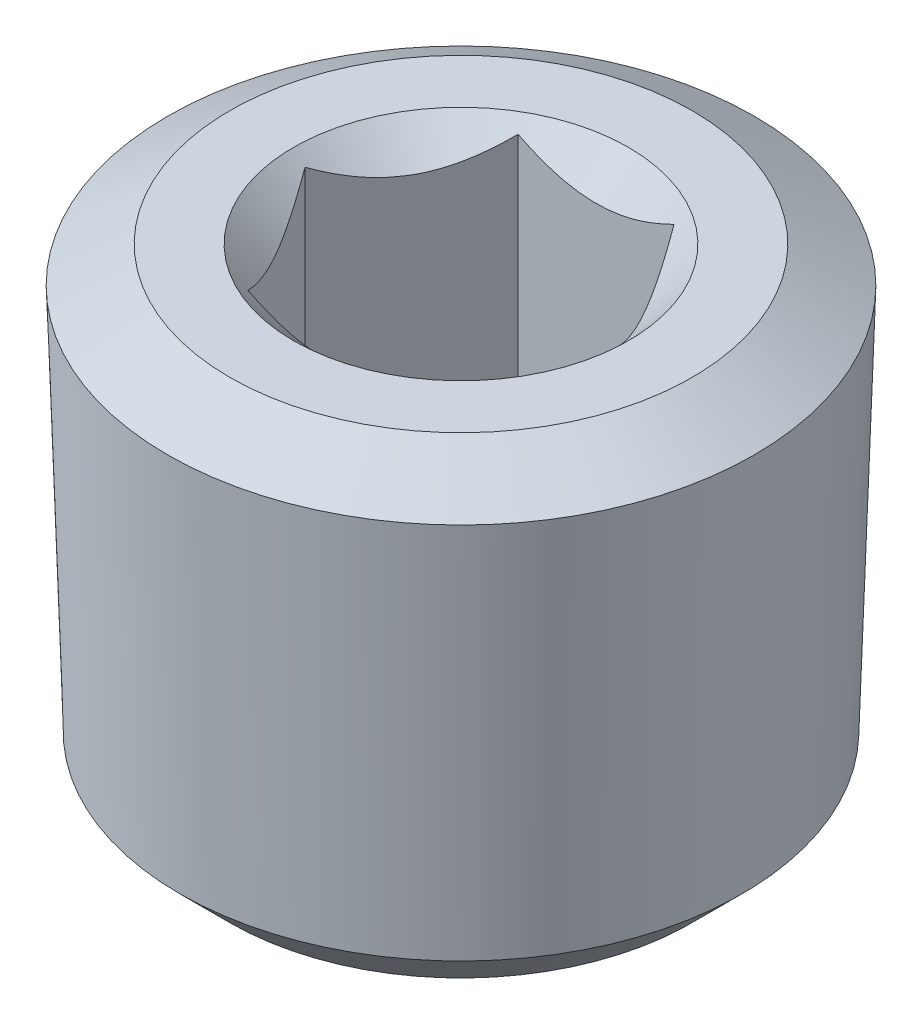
ISO-10303-21;
HEADER;
FILE_DESCRIPTION(('STEP AP214'),'2;1');
FILE_NAME('part.step','',(''),(''),'','','');
FILE_SCHEMA(('AUTOMOTIVE_DESIGN { 1 0 10303 214 1 1 1 1 }'));
ENDSEC;
DATA;
#1=APPLICATION_CONTEXT('core data for automotive mechanical design processes');
#2=APPLICATION_PROTOCOL_DEFINITION('international standard','automotive_design',2000,#1);
#3=PRODUCT_CONTEXT('',#1,'mechanical');
#4=PRODUCT('Part','Part','',(#3));
#5=PRODUCT_RELATED_PRODUCT_CATEGORY('part','',(#4));
#6=PRODUCT_DEFINITION_FORMATION('','',#4);
#7=PRODUCT_DEFINITION_CONTEXT('part definition',#1,'design');
#8=PRODUCT_DEFINITION('design','',#6,#7);
#9=PRODUCT_DEFINITION_SHAPE('','',#8);
#10=(LENGTH_UNIT() NAMED_UNIT(*) SI_UNIT(.MILLI.,.METRE.));
#11=(NAMED_UNIT(*) PLANE_ANGLE_UNIT() SI_UNIT($,.RADIAN.));
#12=(NAMED_UNIT(*) SI_UNIT($,.STERADIAN.) SOLID_ANGLE_UNIT());
#13=UNCERTAINTY_MEASURE_WITH_UNIT(LENGTH_MEASURE(1.E-05),#10,'distance_accuracy_value','');
#14=(GEOMETRIC_REPRESENTATION_CONTEXT(3) GLOBAL_UNCERTAINTY_ASSIGNED_CONTEXT((#13)) GLOBAL_UNIT_ASSIGNED_CONTEXT((#10,
#11,#12)) REPRESENTATION_CONTEXT('',''));
#15=CARTESIAN_POINT('',(0.,0.,0.));
#16=DIRECTION('',(0.,0.,1.));
#17=DIRECTION('',(1.,0.,0.));
#18=AXIS2_PLACEMENT_3D('',#15,#16,#17);
#19=CARTESIAN_POINT('',(0.,0.,0.));
#20=DIRECTION('',(0.,1.,0.));
#21=DIRECTION('',(0.,0.,1.));
#22=AXIS2_PLACEMENT_3D('',#19,#20,#21);
#23=PLANE('',#22);
#24=CARTESIAN_POINT('',(0.,0.,0.));
#25=DIRECTION('',(0.,1.,0.));
#26=DIRECTION('',(0.,0.,1.));
#27=AXIS2_PLACEMENT_3D('',#24,#25,#26);
#28=CIRCLE('',#27,3.937);
#29=CARTESIAN_POINT('',(0.,0.,3.937));
#30=VERTEX_POINT('',#29);
#31=EDGE_CURVE('E246',#30,#30,#28,.T.);
#32=ORIENTED_EDGE('',*,*,#31,.F.);
#33=EDGE_LOOP('',(#32));
#34=FACE_BOUND('',#33,.T.);
#35=CARTESIAN_POINT('',(0.,0.,0.));
#36=DIRECTION('',(0.,1.,0.));
#37=DIRECTION('',(0.,0.,1.));
#38=AXIS2_PLACEMENT_3D('',#35,#36,#37);
#39=CIRCLE('',#38,5.43200174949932);
#40=CARTESIAN_POINT('',(0.,0.,5.43200174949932));
#41=VERTEX_POINT('',#40);
#42=EDGE_CURVE('E12',#41,#41,#39,.T.);
#43=ORIENTED_EDGE('',*,*,#42,.T.);
#44=EDGE_LOOP('',(#43));
#45=FACE_BOUND('',#44,.T.);
#46=ADVANCED_FACE('F33',(#34,#45),#23,.T.);
#47=CARTESIAN_POINT('',(0.,0.,0.));
#48=DIRECTION('',(0.,-1.,0.));
#49=DIRECTION('',(0.,0.,-1.));
#50=AXIS2_PLACEMENT_3D('',#47,#48,#49);
#51=CONICAL_SURFACE('',#50,5.43200174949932,1.0471975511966);
#52=CARTESIAN_POINT('',(0.,-0.844737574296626,0.));
#53=DIRECTION('',(0.,1.,0.));
#54=DIRECTION('',(0.,0.,1.));
#55=AXIS2_PLACEMENT_3D('',#52,#53,#54);
#56=CIRCLE('',#55,6.89513014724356);
#57=CARTESIAN_POINT('',(0.,-0.844737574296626,6.89513014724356));
#58=VERTEX_POINT('',#57);
#59=EDGE_CURVE('E40',#58,#58,#56,.T.);
#60=ORIENTED_EDGE('',*,*,#59,.T.);
#61=EDGE_LOOP('',(#60));
#62=FACE_BOUND('',#61,.T.);
#63=ORIENTED_EDGE('',*,*,#42,.F.);
#64=EDGE_LOOP('',(#63));
#65=FACE_BOUND('',#64,.T.);
#66=ADVANCED_FACE('F236',(#62,#65),#51,.T.);
#67=CARTESIAN_POINT('',(0.,-0.844737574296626,0.));
#68=DIRECTION('',(0.,1.,0.));
#69=DIRECTION('',(0.,0.,1.));
#70=AXIS2_PLACEMENT_3D('',#67,#68,#69);
#71=CONICAL_SURFACE('',#70,6.89513014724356,0.0312064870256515);
#72=CARTESIAN_POINT('',(0.,-9.91996968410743,0.));
#73=DIRECTION('',(0.,1.,0.));
#74=DIRECTION('',(0.,0.,1.));
#75=AXIS2_PLACEMENT_3D('',#72,#73,#74);
#76=CIRCLE('',#75,6.61183206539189);
#77=CARTESIAN_POINT('',(0.,-9.91996968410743,6.61183206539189));
#78=VERTEX_POINT('',#77);
#79=EDGE_CURVE('E254',#78,#78,#76,.T.);
#80=ORIENTED_EDGE('',*,*,#79,.T.);
#81=EDGE_LOOP('',(#80));
#82=FACE_BOUND('',#81,.T.);
#83=ORIENTED_EDGE('',*,*,#59,.F.);
#84=EDGE_LOOP('',(#83));
#85=FACE_BOUND('',#84,.T.);
#86=ADVANCED_FACE('F241',(#82,#85),#71,.T.);
#87=CARTESIAN_POINT('',(0.,-9.91996968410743,0.));
#88=DIRECTION('',(0.,1.,0.));
#89=DIRECTION('',(0.,0.,1.));
#90=AXIS2_PLACEMENT_3D('',#87,#88,#89);
#91=CONICAL_SURFACE('',#90,6.61183206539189,0.785398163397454);
#92=CARTESIAN_POINT('',(0.,-11.0998,0.));
#93=DIRECTION('',(0.,1.,0.));
#94=DIRECTION('',(0.,0.,1.));
#95=AXIS2_PLACEMENT_3D('',#92,#93,#94);
#96=CIRCLE('',#95,5.43200174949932);
#97=CARTESIAN_POINT('',(0.,-11.0998,5.43200174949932));
#98=VERTEX_POINT('',#97);
#99=EDGE_CURVE('E250',#98,#98,#96,.T.);
#100=ORIENTED_EDGE('',*,*,#99,.T.);
#101=EDGE_LOOP('',(#100));
#102=FACE_BOUND('',#101,.T.);
#103=ORIENTED_EDGE('',*,*,#79,.F.);
#104=EDGE_LOOP('',(#103));
#105=FACE_BOUND('',#104,.T.);
#106=ADVANCED_FACE('F264',(#102,#105),#91,.T.);
#107=CARTESIAN_POINT('',(-5.43200174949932,-11.0998,0.));
#108=DIRECTION('',(0.,-1.,0.));
#109=DIRECTION('',(0.,0.,-1.));
#110=AXIS2_PLACEMENT_3D('',#107,#108,#109);
#111=PLANE('',#110);
#112=ORIENTED_EDGE('',*,*,#99,.F.);
#113=EDGE_LOOP('',(#112));
#114=FACE_BOUND('',#113,.T.);
#115=ADVANCED_FACE('F180',(#114),#111,.T.);
#116=CARTESIAN_POINT('',(0.,0.,0.));
#117=DIRECTION('',(0.,1.,0.));
#118=DIRECTION('',(0.,0.,1.));
#119=AXIS2_PLACEMENT_3D('',#116,#117,#118);
#120=CONICAL_SURFACE('',#119,3.937,0.785398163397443);
#121=CARTESIAN_POINT('',(-3.93571910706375,1.11972916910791,3.175));
#122=CARTESIAN_POINT('',(-3.84104338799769,1.04605819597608,3.175));
#123=CARTESIAN_POINT('',(-3.7458702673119,0.973016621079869,3.175));
#124=CARTESIAN_POINT('',(-3.55432152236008,0.828483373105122,3.175));
#125=CARTESIAN_POINT('',(-3.45794562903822,0.756992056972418,3.175));
#126=CARTESIAN_POINT('',(-3.26308115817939,0.615342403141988,3.175));
#127=CARTESIAN_POINT('',(-3.1645820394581,0.54519852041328,3.175));
#128=CARTESIAN_POINT('',(-2.96596703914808,0.407246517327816,3.175));
#129=CARTESIAN_POINT('',(-2.86585126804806,0.339438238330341,3.175));
#130=CARTESIAN_POINT('',(-2.6568963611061,0.20221469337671,3.175));
#131=CARTESIAN_POINT('',(-2.5479247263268,0.133000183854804,3.175));
#132=CARTESIAN_POINT('',(-2.32741654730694,-0.00128644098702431,3.175));
#133=CARTESIAN_POINT('',(-2.21587956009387,-0.0663578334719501,3.175));
#134=CARTESIAN_POINT('',(-1.99018437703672,-0.190984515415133,3.175));
#135=CARTESIAN_POINT('',(-1.87603517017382,-0.250555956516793,3.175));
#136=CARTESIAN_POINT('',(-1.64444175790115,-0.362847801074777,3.175));
#137=CARTESIAN_POINT('',(-1.52699917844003,-0.415571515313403,3.175));
#138=CARTESIAN_POINT('',(-1.30155237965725,-0.506949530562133,3.175));
#139=CARTESIAN_POINT('',(-1.1939199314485,-0.546511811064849,3.175));
#140=CARTESIAN_POINT('',(-0.975818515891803,-0.617028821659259,3.175));
#141=CARTESIAN_POINT('',(-0.865349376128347,-0.647983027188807,3.175));
#142=CARTESIAN_POINT('',(-0.64421673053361,-0.699051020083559,3.175));
#143=CARTESIAN_POINT('',(-0.533601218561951,-0.719369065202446,3.175));
#144=CARTESIAN_POINT('',(-0.310874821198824,-0.748724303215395,3.175));
#145=CARTESIAN_POINT('',(-0.198764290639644,-0.757764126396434,3.175));
#146=CARTESIAN_POINT('',(0.0202799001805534,-0.763730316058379,3.175));
#147=CARTESIAN_POINT('',(0.127198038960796,-0.761228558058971,3.175));
#148=CARTESIAN_POINT('',(0.340248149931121,-0.745589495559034,3.175));
#149=CARTESIAN_POINT('',(0.446380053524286,-0.732451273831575,3.175));
#150=CARTESIAN_POINT('',(0.658892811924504,-0.696075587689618,3.175));
#151=CARTESIAN_POINT('',(0.765241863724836,-0.672655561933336,3.175));
#152=CARTESIAN_POINT('',(0.975578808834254,-0.617048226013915,3.175));
#153=CARTESIAN_POINT('',(1.07956679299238,-0.584861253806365,3.175));
#154=CARTESIAN_POINT('',(1.28885040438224,-0.511832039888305,3.175));
#155=CARTESIAN_POINT('',(1.39404662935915,-0.470708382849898,3.175));
#156=CARTESIAN_POINT('',(1.60173093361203,-0.382096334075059,3.175));
#157=CARTESIAN_POINT('',(1.70421815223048,-0.334605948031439,3.175));
#158=CARTESIAN_POINT('',(1.90698237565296,-0.234377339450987,3.175));
#159=CARTESIAN_POINT('',(2.0072512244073,-0.181622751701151,3.175));
#160=CARTESIAN_POINT('',(2.20549346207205,-0.0720283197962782,3.175));
#161=CARTESIAN_POINT('',(2.30346724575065,-0.0151891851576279,3.175));
#162=CARTESIAN_POINT('',(2.49264239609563,0.0988994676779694,3.175));
#163=CARTESIAN_POINT('',(2.58393963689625,0.155990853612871,3.175));
#164=CARTESIAN_POINT('',(2.76496520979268,0.272616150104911,3.175));
#165=CARTESIAN_POINT('',(2.85469342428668,0.332150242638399,3.175));
#166=CARTESIAN_POINT('',(3.03206818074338,0.452744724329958,3.175));
#167=CARTESIAN_POINT('',(3.11972562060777,0.513789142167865,3.175));
#168=CARTESIAN_POINT('',(3.29383610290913,0.637523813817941,3.175));
#169=CARTESIAN_POINT('',(3.38028947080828,0.700213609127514,3.175));
#170=CARTESIAN_POINT('',(3.46623735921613,0.763577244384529,3.175));
#171=B_SPLINE_CURVE_WITH_KNOTS('',3,(#121,#122,#123,#124,#125,#126,#127,#128,#129,#130,#131,
#132,#133,#134,#135,#136,#137,#138,#139,#140,#141,#142,#143,#144,#145,#146,#147,#148,#149,#150,
#151,#152,#153,#154,#155,#156,#157,#158,#159,#160,#161,#162,#163,#164,#165,#166,#167,#168,#169,
#170),.UNSPECIFIED.,.F.,.F.,(4,2,2,2,2,2,2,2,2,2,2,2,2,2,2,2,2,2,2,2,2,2,2,2,4),(0.,
0.359892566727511,0.719867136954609,1.08260645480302,1.44532108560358,1.83253224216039,
2.21981077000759,2.60591317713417,2.99182820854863,3.33555423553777,3.67930120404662,
4.01617928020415,4.35297877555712,4.67327447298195,4.99359779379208,5.31985449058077,
5.64609861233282,5.98468714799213,6.32338199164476,6.66316466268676,7.00288845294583,
7.3258777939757,7.64889124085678,7.96932699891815,8.28967439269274),.UNSPECIFIED.);
#172=CARTESIAN_POINT('',(1.83308710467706,-0.27082579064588,3.175));
#173=VERTEX_POINT('',#172);
#174=CARTESIAN_POINT('',(-1.83308710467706,-0.27082579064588,3.175));
#175=VERTEX_POINT('',#174);
#176=EDGE_CURVE('E47',#173,#175,#171,.F.);
#177=ORIENTED_EDGE('',*,*,#176,.T.);
#178=CARTESIAN_POINT('',(-1.83297163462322,-0.270710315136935,3.1752));
#179=CARTESIAN_POINT('',(-1.89598269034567,-0.333666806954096,3.06606165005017));
#180=CARTESIAN_POINT('',(-1.9600473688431,-0.392925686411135,2.95509837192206));
#181=CARTESIAN_POINT('',(-2.09068223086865,-0.501427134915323,2.72883215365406));
#182=CARTESIAN_POINT('',(-2.15726483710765,-0.550609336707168,2.61350769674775));
#183=CARTESIAN_POINT('',(-2.29152545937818,-0.634859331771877,2.38096147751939));
#184=CARTESIAN_POINT('',(-2.35916928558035,-0.670138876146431,2.26379893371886));
#185=CARTESIAN_POINT('',(-2.49594609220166,-0.724494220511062,2.02689455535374));
#186=CARTESIAN_POINT('',(-2.56507489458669,-0.743610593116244,1.90715995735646));
#187=CARTESIAN_POINT('',(-2.68421566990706,-0.760858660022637,1.70080208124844));
#188=CARTESIAN_POINT('',(-2.73407378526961,-0.763411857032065,1.61444529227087));
#189=CARTESIAN_POINT('',(-2.83370891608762,-0.759109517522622,1.44187218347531));
#190=CARTESIAN_POINT('',(-2.88348589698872,-0.752250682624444,1.35565592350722));
#191=CARTESIAN_POINT('',(-2.98256827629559,-0.72951590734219,1.1840402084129));
#192=CARTESIAN_POINT('',(-3.03187308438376,-0.713629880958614,1.09864177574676));
#193=CARTESIAN_POINT('',(-3.12963590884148,-0.673707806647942,0.929311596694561));
#194=CARTESIAN_POINT('',(-3.17809398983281,-0.649672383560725,0.845379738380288));
#195=CARTESIAN_POINT('',(-3.26412109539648,-0.600220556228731,0.696376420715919));
#196=CARTESIAN_POINT('',(-3.30188053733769,-0.576104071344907,0.630975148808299));
#197=CARTESIAN_POINT('',(-3.37672152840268,-0.523984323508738,0.501346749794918));
#198=CARTESIAN_POINT('',(-3.41380305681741,-0.495980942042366,0.437119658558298));
#199=CARTESIAN_POINT('',(-3.48717139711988,-0.436715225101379,0.310041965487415));
#200=CARTESIAN_POINT('',(-3.52346029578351,-0.405463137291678,0.247187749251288));
#201=CARTESIAN_POINT('',(-3.59536602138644,-0.340110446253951,0.122643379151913));
#202=CARTESIAN_POINT('',(-3.63098324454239,-0.306011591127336,0.0609525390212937));
#203=CARTESIAN_POINT('',(-3.66628967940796,-0.270710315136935,-0.000199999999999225));
#204=B_SPLINE_CURVE_WITH_KNOTS('',3,(#178,#179,#180,#181,#182,#183,#184,#185,#186,#187,#188,
#189,#190,#191,#192,#193,#194,#195,#196,#197,#198,#199,#200,#201,#202,#203),.UNSPECIFIED.,.F.,
.F.,(4,2,2,2,2,2,2,2,2,2,2,2,4),(0.,0.422910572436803,0.848285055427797,1.26690402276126,
1.68446903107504,1.98329272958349,2.28222117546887,2.58148426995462,2.88072442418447,
3.11844134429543,3.35616551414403,3.59316134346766,3.8300126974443),.UNSPECIFIED.);
#205=CARTESIAN_POINT('',(-3.66617420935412,-0.270825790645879,0.));
#206=VERTEX_POINT('',#205);
#207=EDGE_CURVE('E122',#175,#206,#204,.T.);
#208=ORIENTED_EDGE('',*,*,#207,.T.);
#209=CARTESIAN_POINT('',(-3.66628967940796,-0.270710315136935,0.000200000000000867));
#210=CARTESIAN_POINT('',(-3.60327862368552,-0.333666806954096,-0.108938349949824));
#211=CARTESIAN_POINT('',(-3.53921394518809,-0.392925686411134,-0.219901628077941));
#212=CARTESIAN_POINT('',(-3.40857908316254,-0.501427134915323,-0.44616784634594));
#213=CARTESIAN_POINT('',(-3.34199647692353,-0.550609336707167,-0.561492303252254));
#214=CARTESIAN_POINT('',(-3.20773585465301,-0.634859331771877,-0.794038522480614));
#215=CARTESIAN_POINT('',(-3.14009202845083,-0.670138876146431,-0.911201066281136));
#216=CARTESIAN_POINT('',(-3.00331522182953,-0.724494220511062,-1.14810544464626));
#217=CARTESIAN_POINT('',(-2.93418641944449,-0.743610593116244,-1.26784004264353));
#218=CARTESIAN_POINT('',(-2.81504564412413,-0.760858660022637,-1.47419791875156));
#219=CARTESIAN_POINT('',(-2.76518752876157,-0.763411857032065,-1.56055470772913));
#220=CARTESIAN_POINT('',(-2.66555239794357,-0.759109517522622,-1.73312781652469));
#221=CARTESIAN_POINT('',(-2.61577541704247,-0.752250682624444,-1.81934407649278));
#222=CARTESIAN_POINT('',(-2.51669303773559,-0.72951590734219,-1.9909597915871));
#223=CARTESIAN_POINT('',(-2.46738822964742,-0.713629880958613,-2.07635822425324));
#224=CARTESIAN_POINT('',(-2.36962540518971,-0.673707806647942,-2.24568840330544));
#225=CARTESIAN_POINT('',(-2.32116732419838,-0.649672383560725,-2.32962026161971));
#226=CARTESIAN_POINT('',(-2.23514021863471,-0.600220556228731,-2.47862357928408));
#227=CARTESIAN_POINT('',(-2.1973807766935,-0.576104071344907,-2.5440248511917));
#228=CARTESIAN_POINT('',(-2.1225397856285,-0.523984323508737,-2.67365325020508));
#229=CARTESIAN_POINT('',(-2.08545825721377,-0.495980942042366,-2.7378803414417));
#230=CARTESIAN_POINT('',(-2.0120899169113,-0.436715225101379,-2.86495803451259));
#231=CARTESIAN_POINT('',(-1.97580101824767,-0.405463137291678,-2.92781225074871));
#232=CARTESIAN_POINT('',(-1.90389529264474,-0.34011044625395,-3.05235662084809));
#233=CARTESIAN_POINT('',(-1.8682780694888,-0.306011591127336,-3.11404746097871));
#234=CARTESIAN_POINT('',(-1.83297163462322,-0.270710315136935,-3.1752));
#235=B_SPLINE_CURVE_WITH_KNOTS('',3,(#209,#210,#211,#212,#213,#214,#215,#216,#217,#218,#219,
#220,#221,#222,#223,#224,#225,#226,#227,#228,#229,#230,#231,#232,#233,#234),.UNSPECIFIED.,.F.,
.F.,(4,2,2,2,2,2,2,2,2,2,2,2,4),(0.,0.422910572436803,0.848285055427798,1.26690402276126,
1.68446903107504,1.98329272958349,2.28222117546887,2.58148426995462,2.88072442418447,
3.11844134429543,3.35616551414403,3.59316134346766,3.8300126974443),.UNSPECIFIED.);
#236=CARTESIAN_POINT('',(-1.83308710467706,-0.270825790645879,-3.175));
#237=VERTEX_POINT('',#236);
#238=EDGE_CURVE('E203',#206,#237,#235,.T.);
#239=ORIENTED_EDGE('',*,*,#238,.T.);
#240=CARTESIAN_POINT('',(-3.93571910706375,1.11972916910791,-3.175));
#241=CARTESIAN_POINT('',(-3.84104338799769,1.04605819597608,-3.175));
#242=CARTESIAN_POINT('',(-3.7458702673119,0.973016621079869,-3.175));
#243=CARTESIAN_POINT('',(-3.55432152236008,0.828483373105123,-3.175));
#244=CARTESIAN_POINT('',(-3.45794562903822,0.756992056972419,-3.175));
#245=CARTESIAN_POINT('',(-3.26308115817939,0.615342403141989,-3.175));
#246=CARTESIAN_POINT('',(-3.1645820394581,0.545198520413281,-3.175));
#247=CARTESIAN_POINT('',(-2.96596703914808,0.407246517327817,-3.175));
#248=CARTESIAN_POINT('',(-2.86585126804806,0.339438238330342,-3.175));
#249=CARTESIAN_POINT('',(-2.6568963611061,0.20221469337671,-3.175));
#250=CARTESIAN_POINT('',(-2.54792472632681,0.133000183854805,-3.175));
#251=CARTESIAN_POINT('',(-2.32741654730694,-0.00128644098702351,-3.175));
#252=CARTESIAN_POINT('',(-2.21587956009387,-0.0663578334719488,-3.175));
#253=CARTESIAN_POINT('',(-1.99018437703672,-0.190984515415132,-3.175));
#254=CARTESIAN_POINT('',(-1.87603517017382,-0.250555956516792,-3.175));
#255=CARTESIAN_POINT('',(-1.64444175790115,-0.362847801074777,-3.175));
#256=CARTESIAN_POINT('',(-1.52699917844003,-0.415571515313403,-3.175));
#257=CARTESIAN_POINT('',(-1.30155237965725,-0.506949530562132,-3.175));
#258=CARTESIAN_POINT('',(-1.1939199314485,-0.546511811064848,-3.175));
#259=CARTESIAN_POINT('',(-0.975818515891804,-0.617028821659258,-3.175));
#260=CARTESIAN_POINT('',(-0.865349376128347,-0.647983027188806,-3.175));
#261=CARTESIAN_POINT('',(-0.64421673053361,-0.699051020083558,-3.175));
#262=CARTESIAN_POINT('',(-0.533601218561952,-0.719369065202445,-3.175));
#263=CARTESIAN_POINT('',(-0.310874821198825,-0.748724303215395,-3.175));
#264=CARTESIAN_POINT('',(-0.198764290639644,-0.757764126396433,-3.175));
#265=CARTESIAN_POINT('',(0.020279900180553,-0.763730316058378,-3.175));
#266=CARTESIAN_POINT('',(0.127198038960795,-0.76122855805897,-3.175));
#267=CARTESIAN_POINT('',(0.34024814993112,-0.745589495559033,-3.175));
#268=CARTESIAN_POINT('',(0.446380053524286,-0.732451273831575,-3.175));
#269=CARTESIAN_POINT('',(0.658892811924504,-0.696075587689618,-3.175));
#270=CARTESIAN_POINT('',(0.765241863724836,-0.672655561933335,-3.175));
#271=CARTESIAN_POINT('',(0.975578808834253,-0.617048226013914,-3.175));
#272=CARTESIAN_POINT('',(1.07956679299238,-0.584861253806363,-3.175));
#273=CARTESIAN_POINT('',(1.28885040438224,-0.511832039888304,-3.175));
#274=CARTESIAN_POINT('',(1.39404662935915,-0.470708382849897,-3.175));
#275=CARTESIAN_POINT('',(1.60173093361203,-0.382096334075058,-3.175));
#276=CARTESIAN_POINT('',(1.70421815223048,-0.334605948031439,-3.175));
#277=CARTESIAN_POINT('',(1.90698237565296,-0.234377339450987,-3.175));
#278=CARTESIAN_POINT('',(2.0072512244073,-0.181622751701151,-3.175));
#279=CARTESIAN_POINT('',(2.20549346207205,-0.0720283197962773,-3.175));
#280=CARTESIAN_POINT('',(2.30346724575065,-0.0151891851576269,-3.175));
#281=CARTESIAN_POINT('',(2.49264239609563,0.0988994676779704,-3.175));
#282=CARTESIAN_POINT('',(2.58393963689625,0.155990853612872,-3.175));
#283=CARTESIAN_POINT('',(2.76496520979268,0.272616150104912,-3.175));
#284=CARTESIAN_POINT('',(2.85469342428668,0.3321502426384,-3.175));
#285=CARTESIAN_POINT('',(3.03206818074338,0.452744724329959,-3.175));
#286=CARTESIAN_POINT('',(3.11972562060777,0.513789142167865,-3.175));
#287=CARTESIAN_POINT('',(3.29383610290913,0.637523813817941,-3.175));
#288=CARTESIAN_POINT('',(3.38028947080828,0.700213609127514,-3.175));
#289=CARTESIAN_POINT('',(3.46623735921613,0.76357724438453,-3.175));
#290=B_SPLINE_CURVE_WITH_KNOTS('',3,(#240,#241,#242,#243,#244,#245,#246,#247,#248,#249,#250,
#251,#252,#253,#254,#255,#256,#257,#258,#259,#260,#261,#262,#263,#264,#265,#266,#267,#268,#269,
#270,#271,#272,#273,#274,#275,#276,#277,#278,#279,#280,#281,#282,#283,#284,#285,#286,#287,#288,
#289),.UNSPECIFIED.,.F.,.F.,(4,2,2,2,2,2,2,2,2,2,2,2,2,2,2,2,2,2,2,2,2,2,2,2,4),(0.,
0.35989256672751,0.719867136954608,1.08260645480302,1.44532108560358,1.83253224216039,
2.21981077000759,2.60591317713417,2.99182820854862,3.33555423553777,3.67930120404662,
4.01617928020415,4.35297877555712,4.67327447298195,4.99359779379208,5.31985449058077,
5.64609861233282,5.98468714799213,6.32338199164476,6.66316466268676,7.00288845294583,
7.3258777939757,7.64889124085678,7.96932699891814,8.28967439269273),.UNSPECIFIED.);
#291=CARTESIAN_POINT('',(1.83308710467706,-0.27082579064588,-3.175));
#292=VERTEX_POINT('',#291);
#293=EDGE_CURVE('E196',#237,#292,#290,.T.);
#294=ORIENTED_EDGE('',*,*,#293,.T.);
#295=CARTESIAN_POINT('',(1.83297163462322,-0.270710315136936,-3.1752));
#296=CARTESIAN_POINT('',(1.89598269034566,-0.333666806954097,-3.06606165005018));
#297=CARTESIAN_POINT('',(1.9600473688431,-0.392925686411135,-2.95509837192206));
#298=CARTESIAN_POINT('',(2.09068223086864,-0.501427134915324,-2.72883215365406));
#299=CARTESIAN_POINT('',(2.15726483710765,-0.550609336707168,-2.61350769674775));
#300=CARTESIAN_POINT('',(2.29152545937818,-0.634859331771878,-2.38096147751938));
#301=CARTESIAN_POINT('',(2.35916928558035,-0.670138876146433,-2.26379893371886));
#302=CARTESIAN_POINT('',(2.49594609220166,-0.724494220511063,-2.02689455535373));
#303=CARTESIAN_POINT('',(2.56507489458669,-0.743610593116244,-1.90715995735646));
#304=CARTESIAN_POINT('',(2.68421566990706,-0.760858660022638,-1.70080208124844));
#305=CARTESIAN_POINT('',(2.73407378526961,-0.763411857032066,-1.61444529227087));
#306=CARTESIAN_POINT('',(2.83370891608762,-0.759109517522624,-1.44187218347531));
#307=CARTESIAN_POINT('',(2.88348589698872,-0.752250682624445,-1.35565592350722));
#308=CARTESIAN_POINT('',(2.98256827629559,-0.72951590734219,-1.1840402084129));
#309=CARTESIAN_POINT('',(3.03187308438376,-0.713629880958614,-1.09864177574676));
#310=CARTESIAN_POINT('',(3.12963590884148,-0.673707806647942,-0.92931159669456));
#311=CARTESIAN_POINT('',(3.17809398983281,-0.649672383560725,-0.845379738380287));
#312=CARTESIAN_POINT('',(3.26412109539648,-0.600220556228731,-0.696376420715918));
#313=CARTESIAN_POINT('',(3.30188053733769,-0.576104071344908,-0.630975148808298));
#314=CARTESIAN_POINT('',(3.37672152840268,-0.523984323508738,-0.501346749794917));
#315=CARTESIAN_POINT('',(3.41380305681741,-0.495980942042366,-0.437119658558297));
#316=CARTESIAN_POINT('',(3.48717139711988,-0.436715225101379,-0.310041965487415));
#317=CARTESIAN_POINT('',(3.52346029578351,-0.405463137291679,-0.247187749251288));
#318=CARTESIAN_POINT('',(3.59536602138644,-0.340110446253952,-0.122643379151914));
#319=CARTESIAN_POINT('',(3.63098324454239,-0.306011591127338,-0.0609525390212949));
#320=CARTESIAN_POINT('',(3.66628967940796,-0.270710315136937,0.000199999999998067));
#321=B_SPLINE_CURVE_WITH_KNOTS('',3,(#295,#296,#297,#298,#299,#300,#301,#302,#303,#304,#305,
#306,#307,#308,#309,#310,#311,#312,#313,#314,#315,#316,#317,#318,#319,#320),.UNSPECIFIED.,.F.,
.F.,(4,2,2,2,2,2,2,2,2,2,2,2,4),(0.,0.422910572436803,0.848285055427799,1.26690402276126,
1.68446903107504,1.98329272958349,2.28222117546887,2.58148426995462,2.88072442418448,
3.11844134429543,3.35616551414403,3.59316134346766,3.8300126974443),.UNSPECIFIED.);
#322=CARTESIAN_POINT('',(3.66617420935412,-0.270825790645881,0.));
#323=VERTEX_POINT('',#322);
#324=EDGE_CURVE('E189',#292,#323,#321,.T.);
#325=ORIENTED_EDGE('',*,*,#324,.T.);
#326=CARTESIAN_POINT('',(3.66628967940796,-0.270710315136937,-0.000200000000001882));
#327=CARTESIAN_POINT('',(3.60327862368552,-0.333666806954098,0.108938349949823));
#328=CARTESIAN_POINT('',(3.53921394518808,-0.392925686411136,0.21990162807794));
#329=CARTESIAN_POINT('',(3.40857908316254,-0.501427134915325,0.446167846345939));
#330=CARTESIAN_POINT('',(3.34199647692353,-0.550609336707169,0.561492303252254));
#331=CARTESIAN_POINT('',(3.20773585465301,-0.634859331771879,0.794038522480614));
#332=CARTESIAN_POINT('',(3.14009202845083,-0.670138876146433,0.911201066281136));
#333=CARTESIAN_POINT('',(3.00331522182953,-0.724494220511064,1.14810544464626));
#334=CARTESIAN_POINT('',(2.93418641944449,-0.743610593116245,1.26784004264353));
#335=CARTESIAN_POINT('',(2.81504564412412,-0.760858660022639,1.47419791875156));
#336=CARTESIAN_POINT('',(2.76518752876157,-0.763411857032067,1.56055470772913));
#337=CARTESIAN_POINT('',(2.66555239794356,-0.759109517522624,1.73312781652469));
#338=CARTESIAN_POINT('',(2.61577541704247,-0.752250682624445,1.81934407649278));
#339=CARTESIAN_POINT('',(2.51669303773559,-0.729515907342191,1.9909597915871));
#340=CARTESIAN_POINT('',(2.46738822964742,-0.713629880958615,2.07635822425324));
#341=CARTESIAN_POINT('',(2.36962540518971,-0.673707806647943,2.24568840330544));
#342=CARTESIAN_POINT('',(2.32116732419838,-0.649672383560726,2.32962026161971));
#343=CARTESIAN_POINT('',(2.2351402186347,-0.600220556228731,2.47862357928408));
#344=CARTESIAN_POINT('',(2.1973807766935,-0.576104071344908,2.5440248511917));
#345=CARTESIAN_POINT('',(2.1225397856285,-0.523984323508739,2.67365325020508));
#346=CARTESIAN_POINT('',(2.08545825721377,-0.495980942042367,2.7378803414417));
#347=CARTESIAN_POINT('',(2.0120899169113,-0.436715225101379,2.86495803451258));
#348=CARTESIAN_POINT('',(1.97580101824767,-0.405463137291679,2.92781225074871));
#349=CARTESIAN_POINT('',(1.90389529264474,-0.340110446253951,3.05235662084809));
#350=CARTESIAN_POINT('',(1.8682780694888,-0.306011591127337,3.11404746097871));
#351=CARTESIAN_POINT('',(1.83297163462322,-0.270710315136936,3.1752));
#352=B_SPLINE_CURVE_WITH_KNOTS('',3,(#326,#327,#328,#329,#330,#331,#332,#333,#334,#335,#336,
#337,#338,#339,#340,#341,#342,#343,#344,#345,#346,#347,#348,#349,#350,#351),.UNSPECIFIED.,.F.,
.F.,(4,2,2,2,2,2,2,2,2,2,2,2,4),(0.,0.422910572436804,0.848285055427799,1.26690402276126,
1.68446903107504,1.98329272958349,2.28222117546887,2.58148426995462,2.88072442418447,
3.11844134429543,3.35616551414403,3.59316134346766,3.8300126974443),.UNSPECIFIED.);
#353=EDGE_CURVE('E166',#323,#173,#352,.T.);
#354=ORIENTED_EDGE('',*,*,#353,.T.);
#355=EDGE_LOOP('',(#177,#208,#239,#294,#325,#354));
#356=FACE_BOUND('',#355,.T.);
#357=ORIENTED_EDGE('',*,*,#31,.T.);
#358=EDGE_LOOP('',(#357));
#359=FACE_BOUND('',#358,.T.);
#360=ADVANCED_FACE('F175',(#356,#359),#120,.F.);
#361=CARTESIAN_POINT('',(-3.66617420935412,-5.588,0.));
#362=DIRECTION('',(-0.866025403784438,0.,0.5));
#363=DIRECTION('',(0.5,0.,0.866025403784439));
#364=AXIS2_PLACEMENT_3D('',#361,#362,#363);
#365=PLANE('',#364);
#366=DIRECTION('',(0.,1.,0.));
#367=VECTOR('',#366,1.);
#368=CARTESIAN_POINT('',(-1.83308710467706,-5.588,3.175));
#369=LINE('',#368,#367);
#370=CARTESIAN_POINT('',(-1.83308710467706,-5.588,3.175));
#371=VERTEX_POINT('',#370);
#372=EDGE_CURVE('E119',#371,#175,#369,.T.);
#373=ORIENTED_EDGE('',*,*,#372,.F.);
#374=DIRECTION('',(0.5,0.,0.866025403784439));
#375=VECTOR('',#374,1.);
#376=CARTESIAN_POINT('',(-3.66617420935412,-5.588,0.));
#377=LINE('',#376,#375);
#378=CARTESIAN_POINT('',(-2.74963065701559,-5.588,1.5875));
#379=VERTEX_POINT('',#378);
#380=EDGE_CURVE('E106',#379,#371,#377,.T.);
#381=ORIENTED_EDGE('',*,*,#380,.F.);
#382=CARTESIAN_POINT('',(-3.66617420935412,-5.588,0.));
#383=VERTEX_POINT('',#382);
#384=EDGE_CURVE('E116',#383,#379,#377,.T.);
#385=ORIENTED_EDGE('',*,*,#384,.F.);
#386=DIRECTION('',(0.,1.,0.));
#387=VECTOR('',#386,1.);
#388=CARTESIAN_POINT('',(-3.66617420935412,-5.588,0.));
#389=LINE('',#388,#387);
#390=EDGE_CURVE('E146',#383,#206,#389,.T.);
#391=ORIENTED_EDGE('',*,*,#390,.T.);
#392=ORIENTED_EDGE('',*,*,#207,.F.);
#393=EDGE_LOOP('',(#373,#381,#385,#391,#392));
#394=FACE_BOUND('',#393,.T.);
#395=ADVANCED_FACE('F120',(#394),#365,.F.);
#396=CARTESIAN_POINT('',(-1.83308710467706,-5.588,-3.175));
#397=DIRECTION('',(-0.866025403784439,0.,-0.5));
#398=DIRECTION('',(-0.5,0.,0.866025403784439));
#399=AXIS2_PLACEMENT_3D('',#396,#397,#398);
#400=PLANE('',#399);
#401=ORIENTED_EDGE('',*,*,#390,.F.);
#402=DIRECTION('',(-0.5,0.,0.866025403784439));
#403=VECTOR('',#402,1.);
#404=CARTESIAN_POINT('',(-1.83308710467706,-5.588,-3.175));
#405=LINE('',#404,#403);
#406=CARTESIAN_POINT('',(-2.74963065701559,-5.588,-1.5875));
#407=VERTEX_POINT('',#406);
#408=EDGE_CURVE('E143',#407,#383,#405,.T.);
#409=ORIENTED_EDGE('',*,*,#408,.F.);
#410=CARTESIAN_POINT('',(-1.83308710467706,-5.588,-3.175));
#411=VERTEX_POINT('',#410);
#412=EDGE_CURVE('E125',#411,#407,#405,.T.);
#413=ORIENTED_EDGE('',*,*,#412,.F.);
#414=DIRECTION('',(0.,1.,0.));
#415=VECTOR('',#414,1.);
#416=CARTESIAN_POINT('',(-1.83308710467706,-5.588,-3.175));
#417=LINE('',#416,#415);
#418=EDGE_CURVE('E148',#411,#237,#417,.T.);
#419=ORIENTED_EDGE('',*,*,#418,.T.);
#420=ORIENTED_EDGE('',*,*,#238,.F.);
#421=EDGE_LOOP('',(#401,#409,#413,#419,#420));
#422=FACE_BOUND('',#421,.T.);
#423=ADVANCED_FACE('F214',(#422),#400,.F.);
#424=CARTESIAN_POINT('',(1.83308710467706,-5.588,-3.175));
#425=DIRECTION('',(0.,0.,-1.));
#426=DIRECTION('',(-1.,0.,0.));
#427=AXIS2_PLACEMENT_3D('',#424,#425,#426);
#428=PLANE('',#427);
#429=ORIENTED_EDGE('',*,*,#418,.F.);
#430=DIRECTION('',(-1.,0.,0.));
#431=VECTOR('',#430,1.);
#432=CARTESIAN_POINT('',(1.83308710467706,-5.588,-3.175));
#433=LINE('',#432,#431);
#434=CARTESIAN_POINT('',(0.,-5.588,-3.175));
#435=VERTEX_POINT('',#434);
#436=EDGE_CURVE('E139',#435,#411,#433,.T.);
#437=ORIENTED_EDGE('',*,*,#436,.F.);
#438=CARTESIAN_POINT('',(1.83308710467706,-5.588,-3.175));
#439=VERTEX_POINT('',#438);
#440=EDGE_CURVE('E140',#439,#435,#433,.T.);
#441=ORIENTED_EDGE('',*,*,#440,.F.);
#442=DIRECTION('',(0.,1.,0.));
#443=VECTOR('',#442,1.);
#444=CARTESIAN_POINT('',(1.83308710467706,-5.588,-3.175));
#445=LINE('',#444,#443);
#446=EDGE_CURVE('E151',#439,#292,#445,.T.);
#447=ORIENTED_EDGE('',*,*,#446,.T.);
#448=ORIENTED_EDGE('',*,*,#293,.F.);
#449=EDGE_LOOP('',(#429,#437,#441,#447,#448));
#450=FACE_BOUND('',#449,.T.);
#451=ADVANCED_FACE('F218',(#450),#428,.F.);
#452=CARTESIAN_POINT('',(3.66617420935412,-5.588,0.));
#453=DIRECTION('',(0.866025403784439,0.,-0.5));
#454=DIRECTION('',(-0.5,0.,-0.866025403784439));
#455=AXIS2_PLACEMENT_3D('',#452,#453,#454);
#456=PLANE('',#455);
#457=ORIENTED_EDGE('',*,*,#446,.F.);
#458=DIRECTION('',(-0.5,0.,-0.866025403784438));
#459=VECTOR('',#458,1.);
#460=CARTESIAN_POINT('',(3.66617420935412,-5.588,0.));
#461=LINE('',#460,#459);
#462=CARTESIAN_POINT('',(2.74963065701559,-5.588,-1.5875));
#463=VERTEX_POINT('',#462);
#464=EDGE_CURVE('E135',#463,#439,#461,.T.);
#465=ORIENTED_EDGE('',*,*,#464,.F.);
#466=CARTESIAN_POINT('',(3.66617420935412,-5.588,0.));
#467=VERTEX_POINT('',#466);
#468=EDGE_CURVE('E136',#467,#463,#461,.T.);
#469=ORIENTED_EDGE('',*,*,#468,.F.);
#470=DIRECTION('',(0.,1.,0.));
#471=VECTOR('',#470,1.);
#472=CARTESIAN_POINT('',(3.66617420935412,-5.588,0.));
#473=LINE('',#472,#471);
#474=EDGE_CURVE('E154',#467,#323,#473,.T.);
#475=ORIENTED_EDGE('',*,*,#474,.T.);
#476=ORIENTED_EDGE('',*,*,#324,.F.);
#477=EDGE_LOOP('',(#457,#465,#469,#475,#476));
#478=FACE_BOUND('',#477,.T.);
#479=ADVANCED_FACE('F222',(#478),#456,.F.);
#480=CARTESIAN_POINT('',(1.83308710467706,-5.588,3.175));
#481=DIRECTION('',(0.866025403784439,0.,0.5));
#482=DIRECTION('',(0.5,0.,-0.866025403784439));
#483=AXIS2_PLACEMENT_3D('',#480,#481,#482);
#484=PLANE('',#483);
#485=ORIENTED_EDGE('',*,*,#474,.F.);
#486=DIRECTION('',(0.5,0.,-0.866025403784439));
#487=VECTOR('',#486,1.);
#488=CARTESIAN_POINT('',(1.83308710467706,-5.588,3.175));
#489=LINE('',#488,#487);
#490=CARTESIAN_POINT('',(2.74963065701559,-5.588,1.5875));
#491=VERTEX_POINT('',#490);
#492=EDGE_CURVE('E131',#491,#467,#489,.T.);
#493=ORIENTED_EDGE('',*,*,#492,.F.);
#494=CARTESIAN_POINT('',(1.83308710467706,-5.588,3.175));
#495=VERTEX_POINT('',#494);
#496=EDGE_CURVE('E55',#495,#491,#489,.T.);
#497=ORIENTED_EDGE('',*,*,#496,.F.);
#498=DIRECTION('',(0.,1.,0.));
#499=VECTOR('',#498,1.);
#500=CARTESIAN_POINT('',(1.83308710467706,-5.588,3.175));
#501=LINE('',#500,#499);
#502=EDGE_CURVE('E124',#495,#173,#501,.T.);
#503=ORIENTED_EDGE('',*,*,#502,.T.);
#504=ORIENTED_EDGE('',*,*,#353,.F.);
#505=EDGE_LOOP('',(#485,#493,#497,#503,#504));
#506=FACE_BOUND('',#505,.T.);
#507=ADVANCED_FACE('F226',(#506),#484,.F.);
#508=CARTESIAN_POINT('',(-1.83308710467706,-5.588,3.175));
#509=DIRECTION('',(0.,0.,1.));
#510=DIRECTION('',(1.,0.,0.));
#511=AXIS2_PLACEMENT_3D('',#508,#509,#510);
#512=PLANE('',#511);
#513=ORIENTED_EDGE('',*,*,#502,.F.);
#514=DIRECTION('',(1.,0.,0.));
#515=VECTOR('',#514,1.);
#516=CARTESIAN_POINT('',(-1.83308710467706,-5.588,3.175));
#517=LINE('',#516,#515);
#518=CARTESIAN_POINT('',(0.,-5.588,3.175));
#519=VERTEX_POINT('',#518);
#520=EDGE_CURVE('E130',#519,#495,#517,.T.);
#521=ORIENTED_EDGE('',*,*,#520,.F.);
#522=EDGE_CURVE('E110',#371,#519,#517,.T.);
#523=ORIENTED_EDGE('',*,*,#522,.F.);
#524=ORIENTED_EDGE('',*,*,#372,.T.);
#525=ORIENTED_EDGE('',*,*,#176,.F.);
#526=EDGE_LOOP('',(#513,#521,#523,#524,#525));
#527=FACE_BOUND('',#526,.T.);
#528=ADVANCED_FACE('F129',(#527),#512,.F.);
#529=CARTESIAN_POINT('',(0.,-5.588,0.));
#530=DIRECTION('',(0.,1.,0.));
#531=DIRECTION('',(0.,0.,1.));
#532=AXIS2_PLACEMENT_3D('',#529,#530,#531);
#533=PLANE('',#532);
#534=CARTESIAN_POINT('',(0.,-5.588,0.));
#535=DIRECTION('',(0.,1.,0.));
#536=DIRECTION('',(0.,0.,1.));
#537=AXIS2_PLACEMENT_3D('',#534,#535,#536);
#538=CIRCLE('',#537,3.175);
#539=EDGE_CURVE('E112',#379,#519,#538,.T.);
#540=ORIENTED_EDGE('',*,*,#539,.F.);
#541=ORIENTED_EDGE('',*,*,#380,.T.);
#542=ORIENTED_EDGE('',*,*,#522,.T.);
#543=EDGE_LOOP('',(#540,#541,#542));
#544=FACE_BOUND('',#543,.T.);
#545=ADVANCED_FACE('F108',(#544),#533,.T.);
#546=EDGE_CURVE('E412',#407,#379,#538,.T.);
#547=ORIENTED_EDGE('',*,*,#546,.F.);
#548=ORIENTED_EDGE('',*,*,#408,.T.);
#549=ORIENTED_EDGE('',*,*,#384,.T.);
#550=EDGE_LOOP('',(#547,#548,#549));
#551=FACE_BOUND('',#550,.T.);
#552=ADVANCED_FACE('F320',(#551),#533,.T.);
#553=EDGE_CURVE('E410',#435,#407,#538,.T.);
#554=ORIENTED_EDGE('',*,*,#553,.F.);
#555=ORIENTED_EDGE('',*,*,#436,.T.);
#556=ORIENTED_EDGE('',*,*,#412,.T.);
#557=EDGE_LOOP('',(#554,#555,#556));
#558=FACE_BOUND('',#557,.T.);
#559=ADVANCED_FACE('F329',(#558),#533,.T.);
#560=EDGE_CURVE('E409',#463,#435,#538,.T.);
#561=ORIENTED_EDGE('',*,*,#560,.F.);
#562=ORIENTED_EDGE('',*,*,#464,.T.);
#563=ORIENTED_EDGE('',*,*,#440,.T.);
#564=EDGE_LOOP('',(#561,#562,#563));
#565=FACE_BOUND('',#564,.T.);
#566=ADVANCED_FACE('F338',(#565),#533,.T.);
#567=EDGE_CURVE('E257',#491,#463,#538,.T.);
#568=ORIENTED_EDGE('',*,*,#567,.F.);
#569=ORIENTED_EDGE('',*,*,#492,.T.);
#570=ORIENTED_EDGE('',*,*,#468,.T.);
#571=EDGE_LOOP('',(#568,#569,#570));
#572=FACE_BOUND('',#571,.T.);
#573=ADVANCED_FACE('F347',(#572),#533,.T.);
#574=EDGE_CURVE('E251',#519,#491,#538,.T.);
#575=ORIENTED_EDGE('',*,*,#574,.F.);
#576=ORIENTED_EDGE('',*,*,#520,.T.);
#577=ORIENTED_EDGE('',*,*,#496,.T.);
#578=EDGE_LOOP('',(#575,#576,#577));
#579=FACE_BOUND('',#578,.T.);
#580=ADVANCED_FACE('F321',(#579),#533,.T.);
#581=CARTESIAN_POINT('',(0.,-5.588,0.));
#582=DIRECTION('',(0.,1.,0.));
#583=DIRECTION('',(0.,0.,1.));
#584=AXIS2_PLACEMENT_3D('',#581,#582,#583);
#585=CONICAL_SURFACE('',#584,3.175,1.02974425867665);
#586=CARTESIAN_POINT('',(0.,-7.49573246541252,0.));
#587=VERTEX_POINT('',#586);
#588=VERTEX_LOOP('',#587);
#589=FACE_BOUND('',#588,.T.);
#590=ORIENTED_EDGE('',*,*,#574,.T.);
#591=ORIENTED_EDGE('',*,*,#567,.T.);
#592=ORIENTED_EDGE('',*,*,#560,.T.);
#593=ORIENTED_EDGE('',*,*,#553,.T.);
#594=ORIENTED_EDGE('',*,*,#546,.T.);
#595=ORIENTED_EDGE('',*,*,#539,.T.);
#596=EDGE_LOOP('',(#590,#591,#592,#593,#594,#595));
#597=FACE_BOUND('',#596,.T.);
#598=ADVANCED_FACE('F181',(#589,#597),#585,.F.);
#599=CLOSED_SHELL('',(#46,#66,#86,#106,#115,#360,#395,#423,#451,#479,#507,#528,#545,#552,#559,
#566,#573,#580,#598));
#600=MANIFOLD_SOLID_BREP('B2',#599);
#601=ADVANCED_BREP_SHAPE_REPRESENTATION('',(#18,#600),#14);
#602=SHAPE_DEFINITION_REPRESENTATION(#9,#601);
ENDSEC;
END-ISO-10303-21;
